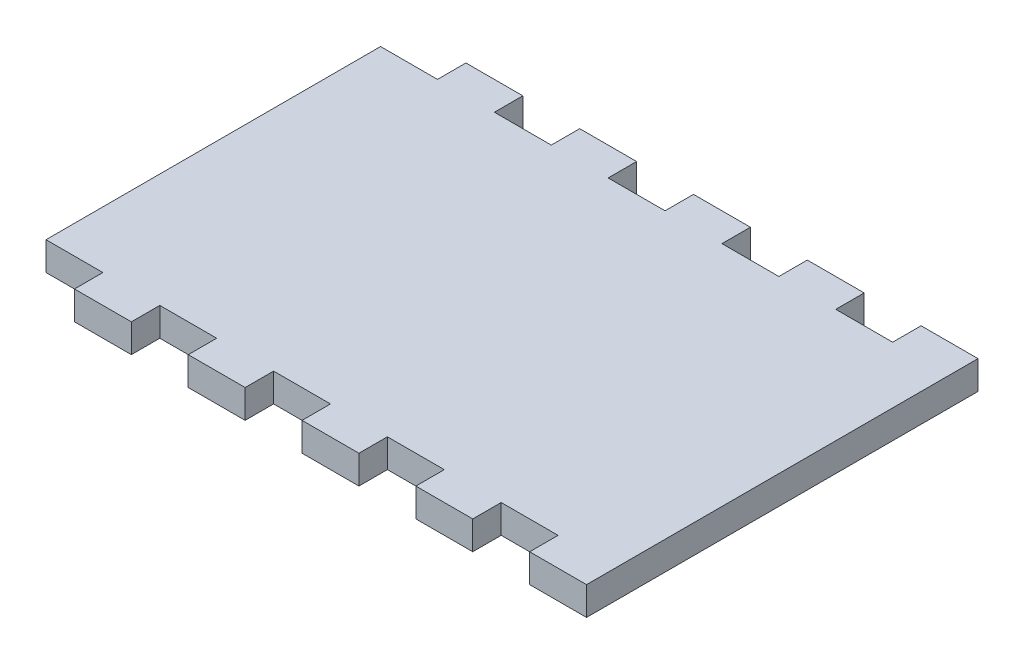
ISO-10303-21;
HEADER;
FILE_DESCRIPTION(('STEP AP214'),'2;1');
FILE_NAME('part.step','',(''),(''),'','','');
FILE_SCHEMA(('AUTOMOTIVE_DESIGN { 1 0 10303 214 1 1 1 1 }'));
ENDSEC;
DATA;
#1=APPLICATION_CONTEXT('core data for automotive mechanical design processes');
#2=APPLICATION_PROTOCOL_DEFINITION('international standard','automotive_design',2000,#1);
#3=PRODUCT_CONTEXT('',#1,'mechanical');
#4=PRODUCT('Part','Part','',(#3));
#5=PRODUCT_RELATED_PRODUCT_CATEGORY('part','',(#4));
#6=PRODUCT_DEFINITION_FORMATION('','',#4);
#7=PRODUCT_DEFINITION_CONTEXT('part definition',#1,'design');
#8=PRODUCT_DEFINITION('design','',#6,#7);
#9=PRODUCT_DEFINITION_SHAPE('','',#8);
#10=(LENGTH_UNIT() NAMED_UNIT(*) SI_UNIT(.MILLI.,.METRE.));
#11=(NAMED_UNIT(*) PLANE_ANGLE_UNIT() SI_UNIT($,.RADIAN.));
#12=(NAMED_UNIT(*) SI_UNIT($,.STERADIAN.) SOLID_ANGLE_UNIT());
#13=UNCERTAINTY_MEASURE_WITH_UNIT(LENGTH_MEASURE(1.E-05),#10,'distance_accuracy_value','');
#14=(GEOMETRIC_REPRESENTATION_CONTEXT(3) GLOBAL_UNCERTAINTY_ASSIGNED_CONTEXT((#13)) GLOBAL_UNIT_ASSIGNED_CONTEXT((#10,
#11,#12)) REPRESENTATION_CONTEXT('',''));
#15=CARTESIAN_POINT('',(0.,0.,0.));
#16=DIRECTION('',(0.,0.,1.));
#17=DIRECTION('',(1.,0.,0.));
#18=AXIS2_PLACEMENT_3D('',#15,#16,#17);
#19=CARTESIAN_POINT('',(0.,3.175,-43.688));
#20=DIRECTION('',(0.,0.,1.));
#21=DIRECTION('',(1.,0.,0.));
#22=AXIS2_PLACEMENT_3D('',#19,#20,#21);
#23=PLANE('',#22);
#24=DIRECTION('',(-1.,0.,0.));
#25=VECTOR('',#24,1.);
#26=CARTESIAN_POINT('',(0.,0.,-43.688));
#27=LINE('',#26,#25);
#28=CARTESIAN_POINT('',(38.1,0.,-43.688));
#29=VERTEX_POINT('',#28);
#30=CARTESIAN_POINT('',(31.75,0.,-43.688));
#31=VERTEX_POINT('',#30);
#32=EDGE_CURVE('E651',#29,#31,#27,.T.);
#33=ORIENTED_EDGE('',*,*,#32,.T.);
#34=DIRECTION('',(0.,1.,0.));
#35=VECTOR('',#34,1.);
#36=CARTESIAN_POINT('',(31.75,-7.09951582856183,-43.688));
#37=LINE('',#36,#35);
#38=CARTESIAN_POINT('',(31.75,3.175,-43.688));
#39=VERTEX_POINT('',#38);
#40=EDGE_CURVE('E351',#31,#39,#37,.T.);
#41=ORIENTED_EDGE('',*,*,#40,.T.);
#42=DIRECTION('',(-1.,0.,0.));
#43=VECTOR('',#42,1.);
#44=CARTESIAN_POINT('',(0.,3.175,-43.688));
#45=LINE('',#44,#43);
#46=CARTESIAN_POINT('',(38.1,3.175,-43.688));
#47=VERTEX_POINT('',#46);
#48=EDGE_CURVE('E671',#47,#39,#45,.T.);
#49=ORIENTED_EDGE('',*,*,#48,.F.);
#50=DIRECTION('',(0.,1.,0.));
#51=VECTOR('',#50,1.);
#52=CARTESIAN_POINT('',(38.1,-7.09951582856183,-43.688));
#53=LINE('',#52,#51);
#54=EDGE_CURVE('E396',#29,#47,#53,.T.);
#55=ORIENTED_EDGE('',*,*,#54,.F.);
#56=EDGE_LOOP('',(#33,#41,#49,#55));
#57=FACE_BOUND('',#56,.T.);
#58=ADVANCED_FACE('F35',(#57),#23,.F.);
#59=CARTESIAN_POINT('',(50.8,0.,-43.688));
#60=VERTEX_POINT('',#59);
#61=CARTESIAN_POINT('',(44.45,0.,-43.688));
#62=VERTEX_POINT('',#61);
#63=EDGE_CURVE('E574',#60,#62,#27,.T.);
#64=ORIENTED_EDGE('',*,*,#63,.T.);
#65=DIRECTION('',(0.,1.,0.));
#66=VECTOR('',#65,1.);
#67=CARTESIAN_POINT('',(44.45,-7.09951582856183,-43.688));
#68=LINE('',#67,#66);
#69=CARTESIAN_POINT('',(44.45,3.175,-43.688));
#70=VERTEX_POINT('',#69);
#71=EDGE_CURVE('E400',#62,#70,#68,.T.);
#72=ORIENTED_EDGE('',*,*,#71,.T.);
#73=CARTESIAN_POINT('',(50.8,3.175,-43.688));
#74=VERTEX_POINT('',#73);
#75=EDGE_CURVE('E562',#74,#70,#45,.T.);
#76=ORIENTED_EDGE('',*,*,#75,.F.);
#77=DIRECTION('',(0.,1.,0.));
#78=VECTOR('',#77,1.);
#79=CARTESIAN_POINT('',(50.8,-7.09951582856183,-43.688));
#80=LINE('',#79,#78);
#81=EDGE_CURVE('E448',#60,#74,#80,.T.);
#82=ORIENTED_EDGE('',*,*,#81,.F.);
#83=EDGE_LOOP('',(#64,#72,#76,#82));
#84=FACE_BOUND('',#83,.T.);
#85=ADVANCED_FACE('F701',(#84),#23,.F.);
#86=CARTESIAN_POINT('',(63.5,0.,-43.688));
#87=VERTEX_POINT('',#86);
#88=CARTESIAN_POINT('',(57.15,0.,-43.688));
#89=VERTEX_POINT('',#88);
#90=EDGE_CURVE('E551',#87,#89,#27,.T.);
#91=ORIENTED_EDGE('',*,*,#90,.T.);
#92=DIRECTION('',(0.,1.,0.));
#93=VECTOR('',#92,1.);
#94=CARTESIAN_POINT('',(57.15,-7.09951582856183,-43.688));
#95=LINE('',#94,#93);
#96=CARTESIAN_POINT('',(57.15,3.175,-43.688));
#97=VERTEX_POINT('',#96);
#98=EDGE_CURVE('E452',#89,#97,#95,.T.);
#99=ORIENTED_EDGE('',*,*,#98,.T.);
#100=CARTESIAN_POINT('',(63.5,3.175,-43.688));
#101=VERTEX_POINT('',#100);
#102=EDGE_CURVE('E559',#101,#97,#45,.T.);
#103=ORIENTED_EDGE('',*,*,#102,.F.);
#104=DIRECTION('',(0.,-1.,0.));
#105=VECTOR('',#104,1.);
#106=CARTESIAN_POINT('',(63.5,3.175,-43.688));
#107=LINE('',#106,#105);
#108=EDGE_CURVE('E43',#101,#87,#107,.T.);
#109=ORIENTED_EDGE('',*,*,#108,.T.);
#110=EDGE_LOOP('',(#91,#99,#103,#109));
#111=FACE_BOUND('',#110,.T.);
#112=ADVANCED_FACE('F581',(#111),#23,.F.);
#113=CARTESIAN_POINT('',(0.,3.175,0.));
#114=DIRECTION('',(0.,0.,-1.));
#115=DIRECTION('',(-1.,0.,0.));
#116=AXIS2_PLACEMENT_3D('',#113,#114,#115);
#117=PLANE('',#116);
#118=DIRECTION('',(1.,0.,0.));
#119=VECTOR('',#118,1.);
#120=CARTESIAN_POINT('',(0.,3.175,0.));
#121=LINE('',#120,#119);
#122=CARTESIAN_POINT('',(19.05,3.175,0.));
#123=VERTEX_POINT('',#122);
#124=CARTESIAN_POINT('',(25.4,3.175,0.));
#125=VERTEX_POINT('',#124);
#126=EDGE_CURVE('E556',#123,#125,#121,.T.);
#127=ORIENTED_EDGE('',*,*,#126,.F.);
#128=DIRECTION('',(0.,1.,0.));
#129=VECTOR('',#128,1.);
#130=CARTESIAN_POINT('',(19.05,-7.09951582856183,0.));
#131=LINE('',#130,#129);
#132=CARTESIAN_POINT('',(19.05,0.,0.));
#133=VERTEX_POINT('',#132);
#134=EDGE_CURVE('E328',#133,#123,#131,.T.);
#135=ORIENTED_EDGE('',*,*,#134,.F.);
#136=DIRECTION('',(1.,0.,0.));
#137=VECTOR('',#136,1.);
#138=CARTESIAN_POINT('',(0.,0.,0.));
#139=LINE('',#138,#137);
#140=CARTESIAN_POINT('',(25.4,0.,0.));
#141=VERTEX_POINT('',#140);
#142=EDGE_CURVE('E315',#133,#141,#139,.T.);
#143=ORIENTED_EDGE('',*,*,#142,.T.);
#144=DIRECTION('',(0.,1.,0.));
#145=VECTOR('',#144,1.);
#146=CARTESIAN_POINT('',(25.4,-7.09951582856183,0.));
#147=LINE('',#146,#145);
#148=EDGE_CURVE('E371',#141,#125,#147,.T.);
#149=ORIENTED_EDGE('',*,*,#148,.T.);
#150=EDGE_LOOP('',(#127,#135,#143,#149));
#151=FACE_BOUND('',#150,.T.);
#152=ADVANCED_FACE('F616',(#151),#117,.F.);
#153=CARTESIAN_POINT('',(31.75,3.175,0.));
#154=VERTEX_POINT('',#153);
#155=CARTESIAN_POINT('',(38.1,3.175,0.));
#156=VERTEX_POINT('',#155);
#157=EDGE_CURVE('E828',#154,#156,#121,.T.);
#158=ORIENTED_EDGE('',*,*,#157,.F.);
#159=DIRECTION('',(0.,1.,0.));
#160=VECTOR('',#159,1.);
#161=CARTESIAN_POINT('',(31.75,-7.09951582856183,0.));
#162=LINE('',#161,#160);
#163=CARTESIAN_POINT('',(31.75,0.,0.));
#164=VERTEX_POINT('',#163);
#165=EDGE_CURVE('E340',#164,#154,#162,.T.);
#166=ORIENTED_EDGE('',*,*,#165,.F.);
#167=CARTESIAN_POINT('',(38.1,0.,0.));
#168=VERTEX_POINT('',#167);
#169=EDGE_CURVE('E606',#164,#168,#139,.T.);
#170=ORIENTED_EDGE('',*,*,#169,.T.);
#171=DIRECTION('',(0.,1.,0.));
#172=VECTOR('',#171,1.);
#173=CARTESIAN_POINT('',(38.1,-7.09951582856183,0.));
#174=LINE('',#173,#172);
#175=EDGE_CURVE('E422',#168,#156,#174,.T.);
#176=ORIENTED_EDGE('',*,*,#175,.T.);
#177=EDGE_LOOP('',(#158,#166,#170,#176));
#178=FACE_BOUND('',#177,.T.);
#179=ADVANCED_FACE('F724',(#178),#117,.F.);
#180=CARTESIAN_POINT('',(44.45,3.175,0.));
#181=VERTEX_POINT('',#180);
#182=CARTESIAN_POINT('',(50.8,3.175,0.));
#183=VERTEX_POINT('',#182);
#184=EDGE_CURVE('E825',#181,#183,#121,.T.);
#185=ORIENTED_EDGE('',*,*,#184,.F.);
#186=DIRECTION('',(0.,1.,0.));
#187=VECTOR('',#186,1.);
#188=CARTESIAN_POINT('',(44.45,-7.09951582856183,0.));
#189=LINE('',#188,#187);
#190=CARTESIAN_POINT('',(44.45,0.,0.));
#191=VERTEX_POINT('',#190);
#192=EDGE_CURVE('E389',#191,#181,#189,.T.);
#193=ORIENTED_EDGE('',*,*,#192,.F.);
#194=CARTESIAN_POINT('',(50.8,0.,0.));
#195=VERTEX_POINT('',#194);
#196=EDGE_CURVE('E604',#191,#195,#139,.T.);
#197=ORIENTED_EDGE('',*,*,#196,.T.);
#198=DIRECTION('',(0.,1.,0.));
#199=VECTOR('',#198,1.);
#200=CARTESIAN_POINT('',(50.8,-7.09951582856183,0.));
#201=LINE('',#200,#199);
#202=EDGE_CURVE('E473',#195,#183,#201,.T.);
#203=ORIENTED_EDGE('',*,*,#202,.T.);
#204=EDGE_LOOP('',(#185,#193,#197,#203));
#205=FACE_BOUND('',#204,.T.);
#206=ADVANCED_FACE('F719',(#205),#117,.F.);
#207=CARTESIAN_POINT('',(57.15,3.175,0.));
#208=VERTEX_POINT('',#207);
#209=CARTESIAN_POINT('',(63.5,3.175,0.));
#210=VERTEX_POINT('',#209);
#211=EDGE_CURVE('E550',#208,#210,#121,.T.);
#212=ORIENTED_EDGE('',*,*,#211,.F.);
#213=DIRECTION('',(0.,1.,0.));
#214=VECTOR('',#213,1.);
#215=CARTESIAN_POINT('',(57.15,-7.09951582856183,0.));
#216=LINE('',#215,#214);
#217=CARTESIAN_POINT('',(57.15,0.,0.));
#218=VERTEX_POINT('',#217);
#219=EDGE_CURVE('E441',#218,#208,#216,.T.);
#220=ORIENTED_EDGE('',*,*,#219,.F.);
#221=CARTESIAN_POINT('',(63.5,0.,0.));
#222=VERTEX_POINT('',#221);
#223=EDGE_CURVE('E566',#218,#222,#139,.T.);
#224=ORIENTED_EDGE('',*,*,#223,.T.);
#225=DIRECTION('',(0.,-1.,0.));
#226=VECTOR('',#225,1.);
#227=CARTESIAN_POINT('',(63.5,3.175,0.));
#228=LINE('',#227,#226);
#229=EDGE_CURVE('E11',#210,#222,#228,.T.);
#230=ORIENTED_EDGE('',*,*,#229,.F.);
#231=EDGE_LOOP('',(#212,#220,#224,#230));
#232=FACE_BOUND('',#231,.T.);
#233=ADVANCED_FACE('F602',(#232),#117,.F.);
#234=CARTESIAN_POINT('',(25.4,3.175,-43.688));
#235=VERTEX_POINT('',#234);
#236=CARTESIAN_POINT('',(19.05,3.175,-43.688));
#237=VERTEX_POINT('',#236);
#238=EDGE_CURVE('E563',#235,#237,#45,.T.);
#239=ORIENTED_EDGE('',*,*,#238,.F.);
#240=DIRECTION('',(0.,1.,0.));
#241=VECTOR('',#240,1.);
#242=CARTESIAN_POINT('',(25.4,-7.09951582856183,-43.688));
#243=LINE('',#242,#241);
#244=CARTESIAN_POINT('',(25.4,0.,-43.688));
#245=VERTEX_POINT('',#244);
#246=EDGE_CURVE('E347',#245,#235,#243,.T.);
#247=ORIENTED_EDGE('',*,*,#246,.F.);
#248=CARTESIAN_POINT('',(19.05,0.,-43.688));
#249=VERTEX_POINT('',#248);
#250=EDGE_CURVE('E575',#245,#249,#27,.T.);
#251=ORIENTED_EDGE('',*,*,#250,.T.);
#252=DIRECTION('',(0.,1.,0.));
#253=VECTOR('',#252,1.);
#254=CARTESIAN_POINT('',(19.05,-7.09951582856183,-43.688));
#255=LINE('',#254,#253);
#256=EDGE_CURVE('E503',#249,#237,#255,.T.);
#257=ORIENTED_EDGE('',*,*,#256,.T.);
#258=EDGE_LOOP('',(#239,#247,#251,#257));
#259=FACE_BOUND('',#258,.T.);
#260=ADVANCED_FACE('F689',(#259),#23,.F.);
#261=CARTESIAN_POINT('',(0.,3.175,0.));
#262=DIRECTION('',(1.,0.,0.));
#263=DIRECTION('',(0.,0.,-1.));
#264=AXIS2_PLACEMENT_3D('',#261,#262,#263);
#265=PLANE('',#264);
#266=DIRECTION('',(0.,0.,1.));
#267=VECTOR('',#266,1.);
#268=CARTESIAN_POINT('',(0.,0.,0.));
#269=LINE('',#268,#267);
#270=CARTESIAN_POINT('',(0.,0.,-40.513));
#271=VERTEX_POINT('',#270);
#272=CARTESIAN_POINT('',(0.,0.,-3.175));
#273=VERTEX_POINT('',#272);
#274=EDGE_CURVE('E546',#271,#273,#269,.T.);
#275=ORIENTED_EDGE('',*,*,#274,.T.);
#276=DIRECTION('',(0.,1.,0.));
#277=VECTOR('',#276,1.);
#278=CARTESIAN_POINT('',(0.,-7.09951582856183,-3.175));
#279=LINE('',#278,#277);
#280=CARTESIAN_POINT('',(0.,3.175,-3.175));
#281=VERTEX_POINT('',#280);
#282=EDGE_CURVE('E521',#273,#281,#279,.T.);
#283=ORIENTED_EDGE('',*,*,#282,.T.);
#284=DIRECTION('',(0.,0.,1.));
#285=VECTOR('',#284,1.);
#286=CARTESIAN_POINT('',(0.,3.175,0.));
#287=LINE('',#286,#285);
#288=CARTESIAN_POINT('',(0.,3.175,-40.513));
#289=VERTEX_POINT('',#288);
#290=EDGE_CURVE('E547',#289,#281,#287,.T.);
#291=ORIENTED_EDGE('',*,*,#290,.F.);
#292=DIRECTION('',(0.,1.,0.));
#293=VECTOR('',#292,1.);
#294=CARTESIAN_POINT('',(0.,-7.09951582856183,-40.513));
#295=LINE('',#294,#293);
#296=EDGE_CURVE('E543',#271,#289,#295,.T.);
#297=ORIENTED_EDGE('',*,*,#296,.F.);
#298=EDGE_LOOP('',(#275,#283,#291,#297));
#299=FACE_BOUND('',#298,.T.);
#300=ADVANCED_FACE('F37',(#299),#265,.F.);
#301=CARTESIAN_POINT('',(6.35,0.,0.));
#302=VERTEX_POINT('',#301);
#303=CARTESIAN_POINT('',(12.7,0.,0.));
#304=VERTEX_POINT('',#303);
#305=EDGE_CURVE('E567',#302,#304,#139,.T.);
#306=ORIENTED_EDGE('',*,*,#305,.T.);
#307=DIRECTION('',(0.,1.,0.));
#308=VECTOR('',#307,1.);
#309=CARTESIAN_POINT('',(12.7,-7.09951582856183,0.));
#310=LINE('',#309,#308);
#311=CARTESIAN_POINT('',(12.7,3.175,0.));
#312=VERTEX_POINT('',#311);
#313=EDGE_CURVE('E324',#304,#312,#310,.T.);
#314=ORIENTED_EDGE('',*,*,#313,.T.);
#315=CARTESIAN_POINT('',(6.35,3.175,0.));
#316=VERTEX_POINT('',#315);
#317=EDGE_CURVE('E552',#316,#312,#121,.T.);
#318=ORIENTED_EDGE('',*,*,#317,.F.);
#319=DIRECTION('',(0.,1.,0.));
#320=VECTOR('',#319,1.);
#321=CARTESIAN_POINT('',(6.35,-7.09951582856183,0.));
#322=LINE('',#321,#320);
#323=EDGE_CURVE('E524',#302,#316,#322,.T.);
#324=ORIENTED_EDGE('',*,*,#323,.F.);
#325=EDGE_LOOP('',(#306,#314,#318,#324));
#326=FACE_BOUND('',#325,.T.);
#327=ADVANCED_FACE('F625',(#326),#117,.F.);
#328=CARTESIAN_POINT('',(63.5,3.175,0.));
#329=DIRECTION('',(-1.,0.,0.));
#330=DIRECTION('',(0.,0.,1.));
#331=AXIS2_PLACEMENT_3D('',#328,#329,#330);
#332=PLANE('',#331);
#333=DIRECTION('',(0.,0.,-1.));
#334=VECTOR('',#333,1.);
#335=CARTESIAN_POINT('',(63.5,0.,0.));
#336=LINE('',#335,#334);
#337=EDGE_CURVE('E570',#222,#87,#336,.T.);
#338=ORIENTED_EDGE('',*,*,#337,.T.);
#339=ORIENTED_EDGE('',*,*,#108,.F.);
#340=DIRECTION('',(0.,0.,-1.));
#341=VECTOR('',#340,1.);
#342=CARTESIAN_POINT('',(63.5,3.175,0.));
#343=LINE('',#342,#341);
#344=EDGE_CURVE('E555',#210,#101,#343,.T.);
#345=ORIENTED_EDGE('',*,*,#344,.F.);
#346=ORIENTED_EDGE('',*,*,#229,.T.);
#347=EDGE_LOOP('',(#338,#339,#345,#346));
#348=FACE_BOUND('',#347,.T.);
#349=ADVANCED_FACE('F600',(#348),#332,.F.);
#350=CARTESIAN_POINT('',(12.7,3.175,-43.688));
#351=VERTEX_POINT('',#350);
#352=CARTESIAN_POINT('',(6.35,3.175,-43.688));
#353=VERTEX_POINT('',#352);
#354=EDGE_CURVE('E558',#351,#353,#45,.T.);
#355=ORIENTED_EDGE('',*,*,#354,.F.);
#356=DIRECTION('',(0.,1.,0.));
#357=VECTOR('',#356,1.);
#358=CARTESIAN_POINT('',(12.7,-7.09951582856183,-43.688));
#359=LINE('',#358,#357);
#360=CARTESIAN_POINT('',(12.7,0.,-43.688));
#361=VERTEX_POINT('',#360);
#362=EDGE_CURVE('E499',#361,#351,#359,.T.);
#363=ORIENTED_EDGE('',*,*,#362,.F.);
#364=CARTESIAN_POINT('',(6.35,0.,-43.688));
#365=VERTEX_POINT('',#364);
#366=EDGE_CURVE('E572',#361,#365,#27,.T.);
#367=ORIENTED_EDGE('',*,*,#366,.T.);
#368=DIRECTION('',(0.,1.,0.));
#369=VECTOR('',#368,1.);
#370=CARTESIAN_POINT('',(6.35,-7.09951582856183,-43.688));
#371=LINE('',#370,#369);
#372=EDGE_CURVE('E540',#365,#353,#371,.T.);
#373=ORIENTED_EDGE('',*,*,#372,.T.);
#374=EDGE_LOOP('',(#355,#363,#367,#373));
#375=FACE_BOUND('',#374,.T.);
#376=ADVANCED_FACE('F649',(#375),#23,.F.);
#377=CARTESIAN_POINT('',(0.,3.175,0.));
#378=DIRECTION('',(0.,-1.,0.));
#379=DIRECTION('',(0.,0.,-1.));
#380=AXIS2_PLACEMENT_3D('',#377,#378,#379);
#381=PLANE('',#380);
#382=DIRECTION('',(-1.,0.,0.));
#383=VECTOR('',#382,1.);
#384=CARTESIAN_POINT('',(12.7,3.175,-3.175));
#385=LINE('',#384,#383);
#386=CARTESIAN_POINT('',(19.05,3.175,-3.175));
#387=VERTEX_POINT('',#386);
#388=CARTESIAN_POINT('',(12.7,3.175,-3.175));
#389=VERTEX_POINT('',#388);
#390=EDGE_CURVE('E318',#387,#389,#385,.T.);
#391=ORIENTED_EDGE('',*,*,#390,.F.);
#392=DIRECTION('',(0.,0.,-1.));
#393=VECTOR('',#392,1.);
#394=CARTESIAN_POINT('',(19.05,3.175,0.));
#395=LINE('',#394,#393);
#396=EDGE_CURVE('E308',#123,#387,#395,.T.);
#397=ORIENTED_EDGE('',*,*,#396,.F.);
#398=ORIENTED_EDGE('',*,*,#126,.T.);
#399=DIRECTION('',(0.,0.,1.));
#400=VECTOR('',#399,1.);
#401=CARTESIAN_POINT('',(25.4,3.175,0.));
#402=LINE('',#401,#400);
#403=CARTESIAN_POINT('',(25.4,3.175,-3.175));
#404=VERTEX_POINT('',#403);
#405=EDGE_CURVE('E357',#404,#125,#402,.T.);
#406=ORIENTED_EDGE('',*,*,#405,.F.);
#407=DIRECTION('',(-1.,0.,0.));
#408=VECTOR('',#407,1.);
#409=CARTESIAN_POINT('',(25.4,3.175,-3.175));
#410=LINE('',#409,#408);
#411=CARTESIAN_POINT('',(31.75,3.175,-3.175));
#412=VERTEX_POINT('',#411);
#413=EDGE_CURVE('E360',#412,#404,#410,.T.);
#414=ORIENTED_EDGE('',*,*,#413,.F.);
#415=DIRECTION('',(0.,0.,-1.));
#416=VECTOR('',#415,1.);
#417=CARTESIAN_POINT('',(31.75,3.175,0.));
#418=LINE('',#417,#416);
#419=EDGE_CURVE('E363',#154,#412,#418,.T.);
#420=ORIENTED_EDGE('',*,*,#419,.F.);
#421=ORIENTED_EDGE('',*,*,#157,.T.);
#422=DIRECTION('',(0.,0.,1.));
#423=VECTOR('',#422,1.);
#424=CARTESIAN_POINT('',(38.1,3.175,0.));
#425=LINE('',#424,#423);
#426=CARTESIAN_POINT('',(38.1,3.175,-3.175));
#427=VERTEX_POINT('',#426);
#428=EDGE_CURVE('E406',#427,#156,#425,.T.);
#429=ORIENTED_EDGE('',*,*,#428,.F.);
#430=DIRECTION('',(-1.,0.,0.));
#431=VECTOR('',#430,1.);
#432=CARTESIAN_POINT('',(38.1,3.175,-3.175));
#433=LINE('',#432,#431);
#434=CARTESIAN_POINT('',(44.45,3.175,-3.175));
#435=VERTEX_POINT('',#434);
#436=EDGE_CURVE('E409',#435,#427,#433,.T.);
#437=ORIENTED_EDGE('',*,*,#436,.F.);
#438=DIRECTION('',(0.,0.,-1.));
#439=VECTOR('',#438,1.);
#440=CARTESIAN_POINT('',(44.45,3.175,0.));
#441=LINE('',#440,#439);
#442=EDGE_CURVE('E412',#181,#435,#441,.T.);
#443=ORIENTED_EDGE('',*,*,#442,.F.);
#444=ORIENTED_EDGE('',*,*,#184,.T.);
#445=DIRECTION('',(0.,0.,1.));
#446=VECTOR('',#445,1.);
#447=CARTESIAN_POINT('',(50.8,3.175,0.));
#448=LINE('',#447,#446);
#449=CARTESIAN_POINT('',(50.8,3.175,-3.175));
#450=VERTEX_POINT('',#449);
#451=EDGE_CURVE('E458',#450,#183,#448,.T.);
#452=ORIENTED_EDGE('',*,*,#451,.F.);
#453=DIRECTION('',(-1.,0.,0.));
#454=VECTOR('',#453,1.);
#455=CARTESIAN_POINT('',(50.8,3.175,-3.175));
#456=LINE('',#455,#454);
#457=CARTESIAN_POINT('',(57.15,3.175,-3.175));
#458=VERTEX_POINT('',#457);
#459=EDGE_CURVE('E461',#458,#450,#456,.T.);
#460=ORIENTED_EDGE('',*,*,#459,.F.);
#461=DIRECTION('',(0.,0.,-1.));
#462=VECTOR('',#461,1.);
#463=CARTESIAN_POINT('',(57.15,3.175,0.));
#464=LINE('',#463,#462);
#465=EDGE_CURVE('E464',#208,#458,#464,.T.);
#466=ORIENTED_EDGE('',*,*,#465,.F.);
#467=ORIENTED_EDGE('',*,*,#211,.T.);
#468=ORIENTED_EDGE('',*,*,#344,.T.);
#469=ORIENTED_EDGE('',*,*,#102,.T.);
#470=DIRECTION('',(0.,0.,-1.));
#471=VECTOR('',#470,1.);
#472=CARTESIAN_POINT('',(57.15,3.175,-43.688));
#473=LINE('',#472,#471);
#474=CARTESIAN_POINT('',(57.15,3.175,-40.513));
#475=VERTEX_POINT('',#474);
#476=EDGE_CURVE('E432',#475,#97,#473,.T.);
#477=ORIENTED_EDGE('',*,*,#476,.F.);
#478=DIRECTION('',(1.,0.,0.));
#479=VECTOR('',#478,1.);
#480=CARTESIAN_POINT('',(50.8,3.175,-40.513));
#481=LINE('',#480,#479);
#482=CARTESIAN_POINT('',(50.8,3.175,-40.513));
#483=VERTEX_POINT('',#482);
#484=EDGE_CURVE('E435',#483,#475,#481,.T.);
#485=ORIENTED_EDGE('',*,*,#484,.F.);
#486=DIRECTION('',(0.,0.,1.));
#487=VECTOR('',#486,1.);
#488=CARTESIAN_POINT('',(50.8,3.175,-43.688));
#489=LINE('',#488,#487);
#490=EDGE_CURVE('E438',#74,#483,#489,.T.);
#491=ORIENTED_EDGE('',*,*,#490,.F.);
#492=ORIENTED_EDGE('',*,*,#75,.T.);
#493=DIRECTION('',(0.,0.,-1.));
#494=VECTOR('',#493,1.);
#495=CARTESIAN_POINT('',(44.45,3.175,-43.688));
#496=LINE('',#495,#494);
#497=CARTESIAN_POINT('',(44.45,3.175,-40.513));
#498=VERTEX_POINT('',#497);
#499=EDGE_CURVE('E381',#498,#70,#496,.T.);
#500=ORIENTED_EDGE('',*,*,#499,.F.);
#501=DIRECTION('',(1.,0.,0.));
#502=VECTOR('',#501,1.);
#503=CARTESIAN_POINT('',(38.1,3.175,-40.513));
#504=LINE('',#503,#502);
#505=CARTESIAN_POINT('',(38.1,3.175,-40.513));
#506=VERTEX_POINT('',#505);
#507=EDGE_CURVE('E384',#506,#498,#504,.T.);
#508=ORIENTED_EDGE('',*,*,#507,.F.);
#509=DIRECTION('',(0.,0.,1.));
#510=VECTOR('',#509,1.);
#511=CARTESIAN_POINT('',(38.1,3.175,-43.688));
#512=LINE('',#511,#510);
#513=EDGE_CURVE('E387',#47,#506,#512,.T.);
#514=ORIENTED_EDGE('',*,*,#513,.F.);
#515=ORIENTED_EDGE('',*,*,#48,.T.);
#516=DIRECTION('',(0.,0.,-1.));
#517=VECTOR('',#516,1.);
#518=CARTESIAN_POINT('',(31.75,3.175,-43.688));
#519=LINE('',#518,#517);
#520=CARTESIAN_POINT('',(31.75,3.175,-40.513));
#521=VERTEX_POINT('',#520);
#522=EDGE_CURVE('E332',#521,#39,#519,.T.);
#523=ORIENTED_EDGE('',*,*,#522,.F.);
#524=DIRECTION('',(1.,0.,0.));
#525=VECTOR('',#524,1.);
#526=CARTESIAN_POINT('',(25.4,3.175,-40.513));
#527=LINE('',#526,#525);
#528=CARTESIAN_POINT('',(25.4,3.175,-40.513));
#529=VERTEX_POINT('',#528);
#530=EDGE_CURVE('E335',#529,#521,#527,.T.);
#531=ORIENTED_EDGE('',*,*,#530,.F.);
#532=DIRECTION('',(0.,0.,1.));
#533=VECTOR('',#532,1.);
#534=CARTESIAN_POINT('',(25.4,3.175,-43.688));
#535=LINE('',#534,#533);
#536=EDGE_CURVE('E338',#235,#529,#535,.T.);
#537=ORIENTED_EDGE('',*,*,#536,.F.);
#538=ORIENTED_EDGE('',*,*,#238,.T.);
#539=DIRECTION('',(0.,0.,-1.));
#540=VECTOR('',#539,1.);
#541=CARTESIAN_POINT('',(19.05,3.175,-43.688));
#542=LINE('',#541,#540);
#543=CARTESIAN_POINT('',(19.05,3.175,-40.513));
#544=VERTEX_POINT('',#543);
#545=EDGE_CURVE('E483',#544,#237,#542,.T.);
#546=ORIENTED_EDGE('',*,*,#545,.F.);
#547=DIRECTION('',(1.,0.,0.));
#548=VECTOR('',#547,1.);
#549=CARTESIAN_POINT('',(12.7,3.175,-40.513));
#550=LINE('',#549,#548);
#551=CARTESIAN_POINT('',(12.7,3.175,-40.513));
#552=VERTEX_POINT('',#551);
#553=EDGE_CURVE('E487',#552,#544,#550,.T.);
#554=ORIENTED_EDGE('',*,*,#553,.F.);
#555=DIRECTION('',(0.,0.,1.));
#556=VECTOR('',#555,1.);
#557=CARTESIAN_POINT('',(12.7,3.175,-43.688));
#558=LINE('',#557,#556);
#559=EDGE_CURVE('E331',#351,#552,#558,.T.);
#560=ORIENTED_EDGE('',*,*,#559,.F.);
#561=ORIENTED_EDGE('',*,*,#354,.T.);
#562=DIRECTION('',(0.,0.,-1.));
#563=VECTOR('',#562,1.);
#564=CARTESIAN_POINT('',(6.35,3.175,-43.688));
#565=LINE('',#564,#563);
#566=CARTESIAN_POINT('',(6.35,3.175,-40.513));
#567=VERTEX_POINT('',#566);
#568=EDGE_CURVE('E528',#567,#353,#565,.T.);
#569=ORIENTED_EDGE('',*,*,#568,.F.);
#570=DIRECTION('',(1.,0.,0.));
#571=VECTOR('',#570,1.);
#572=CARTESIAN_POINT('',(0.,3.175,-40.513));
#573=LINE('',#572,#571);
#574=EDGE_CURVE('E527',#289,#567,#573,.T.);
#575=ORIENTED_EDGE('',*,*,#574,.F.);
#576=ORIENTED_EDGE('',*,*,#290,.T.);
#577=DIRECTION('',(-1.,0.,0.));
#578=VECTOR('',#577,1.);
#579=CARTESIAN_POINT('',(0.,3.175,-3.175));
#580=LINE('',#579,#578);
#581=CARTESIAN_POINT('',(6.35,3.175,-3.175));
#582=VERTEX_POINT('',#581);
#583=EDGE_CURVE('E510',#582,#281,#580,.T.);
#584=ORIENTED_EDGE('',*,*,#583,.F.);
#585=DIRECTION('',(0.,0.,-1.));
#586=VECTOR('',#585,1.);
#587=CARTESIAN_POINT('',(6.35,3.175,0.));
#588=LINE('',#587,#586);
#589=EDGE_CURVE('E509',#316,#582,#588,.T.);
#590=ORIENTED_EDGE('',*,*,#589,.F.);
#591=ORIENTED_EDGE('',*,*,#317,.T.);
#592=DIRECTION('',(0.,0.,1.));
#593=VECTOR('',#592,1.);
#594=CARTESIAN_POINT('',(12.7,3.175,0.));
#595=LINE('',#594,#593);
#596=EDGE_CURVE('E316',#389,#312,#595,.T.);
#597=ORIENTED_EDGE('',*,*,#596,.F.);
#598=EDGE_LOOP('',(#391,#397,#398,#406,#414,#420,#421,#429,#437,#443,#444,#452,#460,#466,#467,
#468,#469,#477,#485,#491,#492,#500,#508,#514,#515,#523,#531,#537,#538,#546,#554,#560,#561,#569,
#575,#576,#584,#590,#591,#597));
#599=FACE_BOUND('',#598,.T.);
#600=ADVANCED_FACE('F596',(#599),#381,.F.);
#601=CARTESIAN_POINT('',(0.,0.,0.));
#602=DIRECTION('',(0.,-1.,0.));
#603=DIRECTION('',(0.,0.,-1.));
#604=AXIS2_PLACEMENT_3D('',#601,#602,#603);
#605=PLANE('',#604);
#606=DIRECTION('',(0.,0.,-1.));
#607=VECTOR('',#606,1.);
#608=CARTESIAN_POINT('',(19.05,0.,0.));
#609=LINE('',#608,#607);
#610=CARTESIAN_POINT('',(19.05,0.,-3.175));
#611=VERTEX_POINT('',#610);
#612=EDGE_CURVE('E305',#133,#611,#609,.T.);
#613=ORIENTED_EDGE('',*,*,#612,.T.);
#614=DIRECTION('',(-1.,0.,0.));
#615=VECTOR('',#614,1.);
#616=CARTESIAN_POINT('',(12.7,0.,-3.175));
#617=LINE('',#616,#615);
#618=CARTESIAN_POINT('',(12.7,0.,-3.175));
#619=VERTEX_POINT('',#618);
#620=EDGE_CURVE('E292',#611,#619,#617,.T.);
#621=ORIENTED_EDGE('',*,*,#620,.T.);
#622=DIRECTION('',(0.,0.,1.));
#623=VECTOR('',#622,1.);
#624=CARTESIAN_POINT('',(12.7,0.,0.));
#625=LINE('',#624,#623);
#626=EDGE_CURVE('E323',#619,#304,#625,.T.);
#627=ORIENTED_EDGE('',*,*,#626,.T.);
#628=ORIENTED_EDGE('',*,*,#305,.F.);
#629=DIRECTION('',(0.,0.,-1.));
#630=VECTOR('',#629,1.);
#631=CARTESIAN_POINT('',(6.35,0.,0.));
#632=LINE('',#631,#630);
#633=CARTESIAN_POINT('',(6.35,0.,-3.175));
#634=VERTEX_POINT('',#633);
#635=EDGE_CURVE('E512',#302,#634,#632,.T.);
#636=ORIENTED_EDGE('',*,*,#635,.T.);
#637=DIRECTION('',(-1.,0.,0.));
#638=VECTOR('',#637,1.);
#639=CARTESIAN_POINT('',(0.,0.,-3.175));
#640=LINE('',#639,#638);
#641=EDGE_CURVE('E518',#634,#273,#640,.T.);
#642=ORIENTED_EDGE('',*,*,#641,.T.);
#643=ORIENTED_EDGE('',*,*,#274,.F.);
#644=DIRECTION('',(1.,0.,0.));
#645=VECTOR('',#644,1.);
#646=CARTESIAN_POINT('',(0.,0.,-40.513));
#647=LINE('',#646,#645);
#648=CARTESIAN_POINT('',(6.35,0.,-40.513));
#649=VERTEX_POINT('',#648);
#650=EDGE_CURVE('E531',#271,#649,#647,.T.);
#651=ORIENTED_EDGE('',*,*,#650,.T.);
#652=DIRECTION('',(0.,0.,-1.));
#653=VECTOR('',#652,1.);
#654=CARTESIAN_POINT('',(6.35,0.,-43.688));
#655=LINE('',#654,#653);
#656=EDGE_CURVE('E537',#649,#365,#655,.T.);
#657=ORIENTED_EDGE('',*,*,#656,.T.);
#658=ORIENTED_EDGE('',*,*,#366,.F.);
#659=DIRECTION('',(0.,0.,1.));
#660=VECTOR('',#659,1.);
#661=CARTESIAN_POINT('',(12.7,0.,-43.688));
#662=LINE('',#661,#660);
#663=CARTESIAN_POINT('',(12.7,0.,-40.513));
#664=VERTEX_POINT('',#663);
#665=EDGE_CURVE('E495',#361,#664,#662,.T.);
#666=ORIENTED_EDGE('',*,*,#665,.T.);
#667=DIRECTION('',(1.,0.,0.));
#668=VECTOR('',#667,1.);
#669=CARTESIAN_POINT('',(12.7,0.,-40.513));
#670=LINE('',#669,#668);
#671=CARTESIAN_POINT('',(19.05,0.,-40.513));
#672=VERTEX_POINT('',#671);
#673=EDGE_CURVE('E486',#664,#672,#670,.T.);
#674=ORIENTED_EDGE('',*,*,#673,.T.);
#675=DIRECTION('',(0.,0.,-1.));
#676=VECTOR('',#675,1.);
#677=CARTESIAN_POINT('',(19.05,0.,-43.688));
#678=LINE('',#677,#676);
#679=EDGE_CURVE('E500',#672,#249,#678,.T.);
#680=ORIENTED_EDGE('',*,*,#679,.T.);
#681=ORIENTED_EDGE('',*,*,#250,.F.);
#682=DIRECTION('',(0.,0.,1.));
#683=VECTOR('',#682,1.);
#684=CARTESIAN_POINT('',(25.4,0.,-43.688));
#685=LINE('',#684,#683);
#686=CARTESIAN_POINT('',(25.4,0.,-40.513));
#687=VERTEX_POINT('',#686);
#688=EDGE_CURVE('E344',#245,#687,#685,.T.);
#689=ORIENTED_EDGE('',*,*,#688,.T.);
#690=DIRECTION('',(1.,0.,0.));
#691=VECTOR('',#690,1.);
#692=CARTESIAN_POINT('',(25.4,0.,-40.513));
#693=LINE('',#692,#691);
#694=CARTESIAN_POINT('',(31.75,0.,-40.513));
#695=VERTEX_POINT('',#694);
#696=EDGE_CURVE('E334',#687,#695,#693,.T.);
#697=ORIENTED_EDGE('',*,*,#696,.T.);
#698=DIRECTION('',(0.,0.,-1.));
#699=VECTOR('',#698,1.);
#700=CARTESIAN_POINT('',(31.75,0.,-43.688));
#701=LINE('',#700,#699);
#702=EDGE_CURVE('E348',#695,#31,#701,.T.);
#703=ORIENTED_EDGE('',*,*,#702,.T.);
#704=ORIENTED_EDGE('',*,*,#32,.F.);
#705=DIRECTION('',(0.,0.,1.));
#706=VECTOR('',#705,1.);
#707=CARTESIAN_POINT('',(38.1,0.,-43.688));
#708=LINE('',#707,#706);
#709=CARTESIAN_POINT('',(38.1,0.,-40.513));
#710=VERTEX_POINT('',#709);
#711=EDGE_CURVE('E393',#29,#710,#708,.T.);
#712=ORIENTED_EDGE('',*,*,#711,.T.);
#713=DIRECTION('',(1.,0.,0.));
#714=VECTOR('',#713,1.);
#715=CARTESIAN_POINT('',(38.1,0.,-40.513));
#716=LINE('',#715,#714);
#717=CARTESIAN_POINT('',(44.45,0.,-40.513));
#718=VERTEX_POINT('',#717);
#719=EDGE_CURVE('E383',#710,#718,#716,.T.);
#720=ORIENTED_EDGE('',*,*,#719,.T.);
#721=DIRECTION('',(0.,0.,-1.));
#722=VECTOR('',#721,1.);
#723=CARTESIAN_POINT('',(44.45,0.,-43.688));
#724=LINE('',#723,#722);
#725=EDGE_CURVE('E397',#718,#62,#724,.T.);
#726=ORIENTED_EDGE('',*,*,#725,.T.);
#727=ORIENTED_EDGE('',*,*,#63,.F.);
#728=DIRECTION('',(0.,0.,1.));
#729=VECTOR('',#728,1.);
#730=CARTESIAN_POINT('',(50.8,0.,-43.688));
#731=LINE('',#730,#729);
#732=CARTESIAN_POINT('',(50.8,0.,-40.513));
#733=VERTEX_POINT('',#732);
#734=EDGE_CURVE('E445',#60,#733,#731,.T.);
#735=ORIENTED_EDGE('',*,*,#734,.T.);
#736=DIRECTION('',(1.,0.,0.));
#737=VECTOR('',#736,1.);
#738=CARTESIAN_POINT('',(50.8,0.,-40.513));
#739=LINE('',#738,#737);
#740=CARTESIAN_POINT('',(57.15,0.,-40.513));
#741=VERTEX_POINT('',#740);
#742=EDGE_CURVE('E434',#733,#741,#739,.T.);
#743=ORIENTED_EDGE('',*,*,#742,.T.);
#744=DIRECTION('',(0.,0.,-1.));
#745=VECTOR('',#744,1.);
#746=CARTESIAN_POINT('',(57.15,0.,-43.688));
#747=LINE('',#746,#745);
#748=EDGE_CURVE('E449',#741,#89,#747,.T.);
#749=ORIENTED_EDGE('',*,*,#748,.T.);
#750=ORIENTED_EDGE('',*,*,#90,.F.);
#751=ORIENTED_EDGE('',*,*,#337,.F.);
#752=ORIENTED_EDGE('',*,*,#223,.F.);
#753=DIRECTION('',(0.,0.,-1.));
#754=VECTOR('',#753,1.);
#755=CARTESIAN_POINT('',(57.15,0.,0.));
#756=LINE('',#755,#754);
#757=CARTESIAN_POINT('',(57.15,0.,-3.175));
#758=VERTEX_POINT('',#757);
#759=EDGE_CURVE('E460',#218,#758,#756,.T.);
#760=ORIENTED_EDGE('',*,*,#759,.T.);
#761=DIRECTION('',(-1.,0.,0.));
#762=VECTOR('',#761,1.);
#763=CARTESIAN_POINT('',(50.8,0.,-3.175));
#764=LINE('',#763,#762);
#765=CARTESIAN_POINT('',(50.8,0.,-3.175));
#766=VERTEX_POINT('',#765);
#767=EDGE_CURVE('E475',#758,#766,#764,.T.);
#768=ORIENTED_EDGE('',*,*,#767,.T.);
#769=DIRECTION('',(0.,0.,1.));
#770=VECTOR('',#769,1.);
#771=CARTESIAN_POINT('',(50.8,0.,0.));
#772=LINE('',#771,#770);
#773=EDGE_CURVE('E470',#766,#195,#772,.T.);
#774=ORIENTED_EDGE('',*,*,#773,.T.);
#775=ORIENTED_EDGE('',*,*,#196,.F.);
#776=DIRECTION('',(0.,0.,-1.));
#777=VECTOR('',#776,1.);
#778=CARTESIAN_POINT('',(44.45,0.,0.));
#779=LINE('',#778,#777);
#780=CARTESIAN_POINT('',(44.45,0.,-3.175));
#781=VERTEX_POINT('',#780);
#782=EDGE_CURVE('E408',#191,#781,#779,.T.);
#783=ORIENTED_EDGE('',*,*,#782,.T.);
#784=DIRECTION('',(-1.,0.,0.));
#785=VECTOR('',#784,1.);
#786=CARTESIAN_POINT('',(38.1,0.,-3.175));
#787=LINE('',#786,#785);
#788=CARTESIAN_POINT('',(38.1,0.,-3.175));
#789=VERTEX_POINT('',#788);
#790=EDGE_CURVE('E424',#781,#789,#787,.T.);
#791=ORIENTED_EDGE('',*,*,#790,.T.);
#792=DIRECTION('',(0.,0.,1.));
#793=VECTOR('',#792,1.);
#794=CARTESIAN_POINT('',(38.1,0.,0.));
#795=LINE('',#794,#793);
#796=EDGE_CURVE('E419',#789,#168,#795,.T.);
#797=ORIENTED_EDGE('',*,*,#796,.T.);
#798=ORIENTED_EDGE('',*,*,#169,.F.);
#799=DIRECTION('',(0.,0.,-1.));
#800=VECTOR('',#799,1.);
#801=CARTESIAN_POINT('',(31.75,0.,0.));
#802=LINE('',#801,#800);
#803=CARTESIAN_POINT('',(31.75,0.,-3.175));
#804=VERTEX_POINT('',#803);
#805=EDGE_CURVE('E359',#164,#804,#802,.T.);
#806=ORIENTED_EDGE('',*,*,#805,.T.);
#807=DIRECTION('',(-1.,0.,0.));
#808=VECTOR('',#807,1.);
#809=CARTESIAN_POINT('',(25.4,0.,-3.175));
#810=LINE('',#809,#808);
#811=CARTESIAN_POINT('',(25.4,0.,-3.175));
#812=VERTEX_POINT('',#811);
#813=EDGE_CURVE('E373',#804,#812,#810,.T.);
#814=ORIENTED_EDGE('',*,*,#813,.T.);
#815=DIRECTION('',(0.,0.,1.));
#816=VECTOR('',#815,1.);
#817=CARTESIAN_POINT('',(25.4,0.,0.));
#818=LINE('',#817,#816);
#819=EDGE_CURVE('E369',#812,#141,#818,.T.);
#820=ORIENTED_EDGE('',*,*,#819,.T.);
#821=ORIENTED_EDGE('',*,*,#142,.F.);
#822=EDGE_LOOP('',(#613,#621,#627,#628,#636,#642,#643,#651,#657,#658,#666,#674,#680,#681,#689,
#697,#703,#704,#712,#720,#726,#727,#735,#743,#749,#750,#751,#752,#760,#768,#774,#775,#783,#791,
#797,#798,#806,#814,#820,#821));
#823=FACE_BOUND('',#822,.T.);
#824=ADVANCED_FACE('F312',(#823),#605,.T.);
#825=CARTESIAN_POINT('',(0.,-7.09951582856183,-40.513));
#826=DIRECTION('',(0.,0.,1.));
#827=DIRECTION('',(1.,0.,0.));
#828=AXIS2_PLACEMENT_3D('',#825,#826,#827);
#829=PLANE('',#828);
#830=ORIENTED_EDGE('',*,*,#296,.T.);
#831=ORIENTED_EDGE('',*,*,#574,.T.);
#832=DIRECTION('',(0.,1.,0.));
#833=VECTOR('',#832,1.);
#834=CARTESIAN_POINT('',(6.35,-7.09951582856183,-40.513));
#835=LINE('',#834,#833);
#836=EDGE_CURVE('E536',#649,#567,#835,.T.);
#837=ORIENTED_EDGE('',*,*,#836,.F.);
#838=ORIENTED_EDGE('',*,*,#650,.F.);
#839=EDGE_LOOP('',(#830,#831,#837,#838));
#840=FACE_BOUND('',#839,.T.);
#841=ADVANCED_FACE('F642',(#840),#829,.F.);
#842=CARTESIAN_POINT('',(6.35,-7.09951582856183,-43.688));
#843=DIRECTION('',(1.,0.,0.));
#844=DIRECTION('',(0.,0.,-1.));
#845=AXIS2_PLACEMENT_3D('',#842,#843,#844);
#846=PLANE('',#845);
#847=ORIENTED_EDGE('',*,*,#836,.T.);
#848=ORIENTED_EDGE('',*,*,#568,.T.);
#849=ORIENTED_EDGE('',*,*,#372,.F.);
#850=ORIENTED_EDGE('',*,*,#656,.F.);
#851=EDGE_LOOP('',(#847,#848,#849,#850));
#852=FACE_BOUND('',#851,.T.);
#853=ADVANCED_FACE('F646',(#852),#846,.F.);
#854=CARTESIAN_POINT('',(6.35,-7.09951582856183,0.));
#855=DIRECTION('',(1.,0.,0.));
#856=DIRECTION('',(0.,0.,-1.));
#857=AXIS2_PLACEMENT_3D('',#854,#855,#856);
#858=PLANE('',#857);
#859=ORIENTED_EDGE('',*,*,#323,.T.);
#860=ORIENTED_EDGE('',*,*,#589,.T.);
#861=DIRECTION('',(0.,1.,0.));
#862=VECTOR('',#861,1.);
#863=CARTESIAN_POINT('',(6.35,-7.09951582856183,-3.175));
#864=LINE('',#863,#862);
#865=EDGE_CURVE('E517',#634,#582,#864,.T.);
#866=ORIENTED_EDGE('',*,*,#865,.F.);
#867=ORIENTED_EDGE('',*,*,#635,.F.);
#868=EDGE_LOOP('',(#859,#860,#866,#867));
#869=FACE_BOUND('',#868,.T.);
#870=ADVANCED_FACE('F631',(#869),#858,.F.);
#871=CARTESIAN_POINT('',(0.,-7.09951582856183,-3.175));
#872=DIRECTION('',(0.,0.,-1.));
#873=DIRECTION('',(-1.,0.,0.));
#874=AXIS2_PLACEMENT_3D('',#871,#872,#873);
#875=PLANE('',#874);
#876=ORIENTED_EDGE('',*,*,#865,.T.);
#877=ORIENTED_EDGE('',*,*,#583,.T.);
#878=ORIENTED_EDGE('',*,*,#282,.F.);
#879=ORIENTED_EDGE('',*,*,#641,.F.);
#880=EDGE_LOOP('',(#876,#877,#878,#879));
#881=FACE_BOUND('',#880,.T.);
#882=ADVANCED_FACE('F634',(#881),#875,.F.);
#883=CARTESIAN_POINT('',(12.7,-7.09951582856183,-40.513));
#884=DIRECTION('',(0.,0.,1.));
#885=DIRECTION('',(1.,0.,0.));
#886=AXIS2_PLACEMENT_3D('',#883,#884,#885);
#887=PLANE('',#886);
#888=DIRECTION('',(0.,1.,0.));
#889=VECTOR('',#888,1.);
#890=CARTESIAN_POINT('',(12.7,-7.09951582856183,-40.513));
#891=LINE('',#890,#889);
#892=EDGE_CURVE('E498',#664,#552,#891,.T.);
#893=ORIENTED_EDGE('',*,*,#892,.T.);
#894=ORIENTED_EDGE('',*,*,#553,.T.);
#895=DIRECTION('',(0.,1.,0.));
#896=VECTOR('',#895,1.);
#897=CARTESIAN_POINT('',(19.05,-7.09951582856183,-40.513));
#898=LINE('',#897,#896);
#899=EDGE_CURVE('E494',#672,#544,#898,.T.);
#900=ORIENTED_EDGE('',*,*,#899,.F.);
#901=ORIENTED_EDGE('',*,*,#673,.F.);
#902=EDGE_LOOP('',(#893,#894,#900,#901));
#903=FACE_BOUND('',#902,.T.);
#904=ADVANCED_FACE('F684',(#903),#887,.F.);
#905=CARTESIAN_POINT('',(19.05,-7.09951582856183,-43.688));
#906=DIRECTION('',(1.,0.,0.));
#907=DIRECTION('',(0.,0.,-1.));
#908=AXIS2_PLACEMENT_3D('',#905,#906,#907);
#909=PLANE('',#908);
#910=ORIENTED_EDGE('',*,*,#899,.T.);
#911=ORIENTED_EDGE('',*,*,#545,.T.);
#912=ORIENTED_EDGE('',*,*,#256,.F.);
#913=ORIENTED_EDGE('',*,*,#679,.F.);
#914=EDGE_LOOP('',(#910,#911,#912,#913));
#915=FACE_BOUND('',#914,.T.);
#916=ADVANCED_FACE('F686',(#915),#909,.F.);
#917=CARTESIAN_POINT('',(12.7,-7.09951582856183,-43.688));
#918=DIRECTION('',(-1.,0.,0.));
#919=DIRECTION('',(0.,0.,1.));
#920=AXIS2_PLACEMENT_3D('',#917,#918,#919);
#921=PLANE('',#920);
#922=ORIENTED_EDGE('',*,*,#362,.T.);
#923=ORIENTED_EDGE('',*,*,#559,.T.);
#924=ORIENTED_EDGE('',*,*,#892,.F.);
#925=ORIENTED_EDGE('',*,*,#665,.F.);
#926=EDGE_LOOP('',(#922,#923,#924,#925));
#927=FACE_BOUND('',#926,.T.);
#928=ADVANCED_FACE('F679',(#927),#921,.F.);
#929=CARTESIAN_POINT('',(57.15,-7.09951582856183,0.));
#930=DIRECTION('',(1.,0.,0.));
#931=DIRECTION('',(0.,0.,-1.));
#932=AXIS2_PLACEMENT_3D('',#929,#930,#931);
#933=PLANE('',#932);
#934=ORIENTED_EDGE('',*,*,#219,.T.);
#935=ORIENTED_EDGE('',*,*,#465,.T.);
#936=DIRECTION('',(0.,1.,0.));
#937=VECTOR('',#936,1.);
#938=CARTESIAN_POINT('',(57.15,-7.09951582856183,-3.175));
#939=LINE('',#938,#937);
#940=EDGE_CURVE('E469',#758,#458,#939,.T.);
#941=ORIENTED_EDGE('',*,*,#940,.F.);
#942=ORIENTED_EDGE('',*,*,#759,.F.);
#943=EDGE_LOOP('',(#934,#935,#941,#942));
#944=FACE_BOUND('',#943,.T.);
#945=ADVANCED_FACE('F866',(#944),#933,.F.);
#946=CARTESIAN_POINT('',(50.8,-7.09951582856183,-3.175));
#947=DIRECTION('',(0.,0.,-1.));
#948=DIRECTION('',(-1.,0.,0.));
#949=AXIS2_PLACEMENT_3D('',#946,#947,#948);
#950=PLANE('',#949);
#951=ORIENTED_EDGE('',*,*,#940,.T.);
#952=ORIENTED_EDGE('',*,*,#459,.T.);
#953=DIRECTION('',(0.,1.,0.));
#954=VECTOR('',#953,1.);
#955=CARTESIAN_POINT('',(50.8,-7.09951582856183,-3.175));
#956=LINE('',#955,#954);
#957=EDGE_CURVE('E474',#766,#450,#956,.T.);
#958=ORIENTED_EDGE('',*,*,#957,.F.);
#959=ORIENTED_EDGE('',*,*,#767,.F.);
#960=EDGE_LOOP('',(#951,#952,#958,#959));
#961=FACE_BOUND('',#960,.T.);
#962=ADVANCED_FACE('F862',(#961),#950,.F.);
#963=CARTESIAN_POINT('',(50.8,-7.09951582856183,0.));
#964=DIRECTION('',(-1.,0.,0.));
#965=DIRECTION('',(0.,0.,1.));
#966=AXIS2_PLACEMENT_3D('',#963,#964,#965);
#967=PLANE('',#966);
#968=ORIENTED_EDGE('',*,*,#957,.T.);
#969=ORIENTED_EDGE('',*,*,#451,.T.);
#970=ORIENTED_EDGE('',*,*,#202,.F.);
#971=ORIENTED_EDGE('',*,*,#773,.F.);
#972=EDGE_LOOP('',(#968,#969,#970,#971));
#973=FACE_BOUND('',#972,.T.);
#974=ADVANCED_FACE('F859',(#973),#967,.F.);
#975=CARTESIAN_POINT('',(50.8,-7.09951582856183,-40.513));
#976=DIRECTION('',(0.,0.,1.));
#977=DIRECTION('',(1.,0.,0.));
#978=AXIS2_PLACEMENT_3D('',#975,#976,#977);
#979=PLANE('',#978);
#980=DIRECTION('',(0.,1.,0.));
#981=VECTOR('',#980,1.);
#982=CARTESIAN_POINT('',(50.8,-7.09951582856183,-40.513));
#983=LINE('',#982,#981);
#984=EDGE_CURVE('E415',#733,#483,#983,.T.);
#985=ORIENTED_EDGE('',*,*,#984,.T.);
#986=ORIENTED_EDGE('',*,*,#484,.T.);
#987=DIRECTION('',(0.,1.,0.));
#988=VECTOR('',#987,1.);
#989=CARTESIAN_POINT('',(57.15,-7.09951582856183,-40.513));
#990=LINE('',#989,#988);
#991=EDGE_CURVE('E444',#741,#475,#990,.T.);
#992=ORIENTED_EDGE('',*,*,#991,.F.);
#993=ORIENTED_EDGE('',*,*,#742,.F.);
#994=EDGE_LOOP('',(#985,#986,#992,#993));
#995=FACE_BOUND('',#994,.T.);
#996=ADVANCED_FACE('F591',(#995),#979,.F.);
#997=CARTESIAN_POINT('',(57.15,-7.09951582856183,-43.688));
#998=DIRECTION('',(1.,0.,0.));
#999=DIRECTION('',(0.,0.,-1.));
#1000=AXIS2_PLACEMENT_3D('',#997,#998,#999);
#1001=PLANE('',#1000);
#1002=ORIENTED_EDGE('',*,*,#991,.T.);
#1003=ORIENTED_EDGE('',*,*,#476,.T.);
#1004=ORIENTED_EDGE('',*,*,#98,.F.);
#1005=ORIENTED_EDGE('',*,*,#748,.F.);
#1006=EDGE_LOOP('',(#1002,#1003,#1004,#1005));
#1007=FACE_BOUND('',#1006,.T.);
#1008=ADVANCED_FACE('F589',(#1007),#1001,.F.);
#1009=CARTESIAN_POINT('',(50.8,-7.09951582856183,-43.688));
#1010=DIRECTION('',(-1.,0.,0.));
#1011=DIRECTION('',(0.,0.,1.));
#1012=AXIS2_PLACEMENT_3D('',#1009,#1010,#1011);
#1013=PLANE('',#1012);
#1014=ORIENTED_EDGE('',*,*,#81,.T.);
#1015=ORIENTED_EDGE('',*,*,#490,.T.);
#1016=ORIENTED_EDGE('',*,*,#984,.F.);
#1017=ORIENTED_EDGE('',*,*,#734,.F.);
#1018=EDGE_LOOP('',(#1014,#1015,#1016,#1017));
#1019=FACE_BOUND('',#1018,.T.);
#1020=ADVANCED_FACE('F844',(#1019),#1013,.F.);
#1021=CARTESIAN_POINT('',(44.45,-7.09951582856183,0.));
#1022=DIRECTION('',(1.,0.,0.));
#1023=DIRECTION('',(0.,0.,-1.));
#1024=AXIS2_PLACEMENT_3D('',#1021,#1022,#1023);
#1025=PLANE('',#1024);
#1026=ORIENTED_EDGE('',*,*,#192,.T.);
#1027=ORIENTED_EDGE('',*,*,#442,.T.);
#1028=DIRECTION('',(0.,1.,0.));
#1029=VECTOR('',#1028,1.);
#1030=CARTESIAN_POINT('',(44.45,-7.09951582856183,-3.175));
#1031=LINE('',#1030,#1029);
#1032=EDGE_CURVE('E418',#781,#435,#1031,.T.);
#1033=ORIENTED_EDGE('',*,*,#1032,.F.);
#1034=ORIENTED_EDGE('',*,*,#782,.F.);
#1035=EDGE_LOOP('',(#1026,#1027,#1033,#1034));
#1036=FACE_BOUND('',#1035,.T.);
#1037=ADVANCED_FACE('F842',(#1036),#1025,.F.);
#1038=CARTESIAN_POINT('',(38.1,-7.09951582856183,-3.175));
#1039=DIRECTION('',(0.,0.,-1.));
#1040=DIRECTION('',(-1.,0.,0.));
#1041=AXIS2_PLACEMENT_3D('',#1038,#1039,#1040);
#1042=PLANE('',#1041);
#1043=ORIENTED_EDGE('',*,*,#1032,.T.);
#1044=ORIENTED_EDGE('',*,*,#436,.T.);
#1045=DIRECTION('',(0.,1.,0.));
#1046=VECTOR('',#1045,1.);
#1047=CARTESIAN_POINT('',(38.1,-7.09951582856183,-3.175));
#1048=LINE('',#1047,#1046);
#1049=EDGE_CURVE('E423',#789,#427,#1048,.T.);
#1050=ORIENTED_EDGE('',*,*,#1049,.F.);
#1051=ORIENTED_EDGE('',*,*,#790,.F.);
#1052=EDGE_LOOP('',(#1043,#1044,#1050,#1051));
#1053=FACE_BOUND('',#1052,.T.);
#1054=ADVANCED_FACE('F840',(#1053),#1042,.F.);
#1055=CARTESIAN_POINT('',(38.1,-7.09951582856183,0.));
#1056=DIRECTION('',(-1.,0.,0.));
#1057=DIRECTION('',(0.,0.,1.));
#1058=AXIS2_PLACEMENT_3D('',#1055,#1056,#1057);
#1059=PLANE('',#1058);
#1060=ORIENTED_EDGE('',*,*,#1049,.T.);
#1061=ORIENTED_EDGE('',*,*,#428,.T.);
#1062=ORIENTED_EDGE('',*,*,#175,.F.);
#1063=ORIENTED_EDGE('',*,*,#796,.F.);
#1064=EDGE_LOOP('',(#1060,#1061,#1062,#1063));
#1065=FACE_BOUND('',#1064,.T.);
#1066=ADVANCED_FACE('F836',(#1065),#1059,.F.);
#1067=CARTESIAN_POINT('',(38.1,-7.09951582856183,-40.513));
#1068=DIRECTION('',(0.,0.,1.));
#1069=DIRECTION('',(1.,0.,0.));
#1070=AXIS2_PLACEMENT_3D('',#1067,#1068,#1069);
#1071=PLANE('',#1070);
#1072=DIRECTION('',(0.,1.,0.));
#1073=VECTOR('',#1072,1.);
#1074=CARTESIAN_POINT('',(38.1,-7.09951582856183,-40.513));
#1075=LINE('',#1074,#1073);
#1076=EDGE_CURVE('E58',#710,#506,#1075,.T.);
#1077=ORIENTED_EDGE('',*,*,#1076,.T.);
#1078=ORIENTED_EDGE('',*,*,#507,.T.);
#1079=DIRECTION('',(0.,1.,0.));
#1080=VECTOR('',#1079,1.);
#1081=CARTESIAN_POINT('',(44.45,-7.09951582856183,-40.513));
#1082=LINE('',#1081,#1080);
#1083=EDGE_CURVE('E392',#718,#498,#1082,.T.);
#1084=ORIENTED_EDGE('',*,*,#1083,.F.);
#1085=ORIENTED_EDGE('',*,*,#719,.F.);
#1086=EDGE_LOOP('',(#1077,#1078,#1084,#1085));
#1087=FACE_BOUND('',#1086,.T.);
#1088=ADVANCED_FACE('F957',(#1087),#1071,.F.);
#1089=CARTESIAN_POINT('',(44.45,-7.09951582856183,-43.688));
#1090=DIRECTION('',(1.,0.,0.));
#1091=DIRECTION('',(0.,0.,-1.));
#1092=AXIS2_PLACEMENT_3D('',#1089,#1090,#1091);
#1093=PLANE('',#1092);
#1094=ORIENTED_EDGE('',*,*,#1083,.T.);
#1095=ORIENTED_EDGE('',*,*,#499,.T.);
#1096=ORIENTED_EDGE('',*,*,#71,.F.);
#1097=ORIENTED_EDGE('',*,*,#725,.F.);
#1098=EDGE_LOOP('',(#1094,#1095,#1096,#1097));
#1099=FACE_BOUND('',#1098,.T.);
#1100=ADVANCED_FACE('F965',(#1099),#1093,.F.);
#1101=CARTESIAN_POINT('',(38.1,-7.09951582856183,-43.688));
#1102=DIRECTION('',(-1.,0.,0.));
#1103=DIRECTION('',(0.,0.,1.));
#1104=AXIS2_PLACEMENT_3D('',#1101,#1102,#1103);
#1105=PLANE('',#1104);
#1106=ORIENTED_EDGE('',*,*,#54,.T.);
#1107=ORIENTED_EDGE('',*,*,#513,.T.);
#1108=ORIENTED_EDGE('',*,*,#1076,.F.);
#1109=ORIENTED_EDGE('',*,*,#711,.F.);
#1110=EDGE_LOOP('',(#1106,#1107,#1108,#1109));
#1111=FACE_BOUND('',#1110,.T.);
#1112=ADVANCED_FACE('F975',(#1111),#1105,.F.);
#1113=CARTESIAN_POINT('',(31.75,-7.09951582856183,0.));
#1114=DIRECTION('',(1.,0.,0.));
#1115=DIRECTION('',(0.,0.,-1.));
#1116=AXIS2_PLACEMENT_3D('',#1113,#1114,#1115);
#1117=PLANE('',#1116);
#1118=ORIENTED_EDGE('',*,*,#165,.T.);
#1119=ORIENTED_EDGE('',*,*,#419,.T.);
#1120=DIRECTION('',(0.,1.,0.));
#1121=VECTOR('',#1120,1.);
#1122=CARTESIAN_POINT('',(31.75,-7.09951582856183,-3.175));
#1123=LINE('',#1122,#1121);
#1124=EDGE_CURVE('E368',#804,#412,#1123,.T.);
#1125=ORIENTED_EDGE('',*,*,#1124,.F.);
#1126=ORIENTED_EDGE('',*,*,#805,.F.);
#1127=EDGE_LOOP('',(#1118,#1119,#1125,#1126));
#1128=FACE_BOUND('',#1127,.T.);
#1129=ADVANCED_FACE('F985',(#1128),#1117,.F.);
#1130=CARTESIAN_POINT('',(25.4,-7.09951582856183,-3.175));
#1131=DIRECTION('',(0.,0.,-1.));
#1132=DIRECTION('',(-1.,0.,0.));
#1133=AXIS2_PLACEMENT_3D('',#1130,#1131,#1132);
#1134=PLANE('',#1133);
#1135=ORIENTED_EDGE('',*,*,#1124,.T.);
#1136=ORIENTED_EDGE('',*,*,#413,.T.);
#1137=DIRECTION('',(0.,1.,0.));
#1138=VECTOR('',#1137,1.);
#1139=CARTESIAN_POINT('',(25.4,-7.09951582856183,-3.175));
#1140=LINE('',#1139,#1138);
#1141=EDGE_CURVE('E372',#812,#404,#1140,.T.);
#1142=ORIENTED_EDGE('',*,*,#1141,.F.);
#1143=ORIENTED_EDGE('',*,*,#813,.F.);
#1144=EDGE_LOOP('',(#1135,#1136,#1142,#1143));
#1145=FACE_BOUND('',#1144,.T.);
#1146=ADVANCED_FACE('F994',(#1145),#1134,.F.);
#1147=CARTESIAN_POINT('',(25.4,-7.09951582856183,0.));
#1148=DIRECTION('',(-1.,0.,0.));
#1149=DIRECTION('',(0.,0.,1.));
#1150=AXIS2_PLACEMENT_3D('',#1147,#1148,#1149);
#1151=PLANE('',#1150);
#1152=ORIENTED_EDGE('',*,*,#1141,.T.);
#1153=ORIENTED_EDGE('',*,*,#405,.T.);
#1154=ORIENTED_EDGE('',*,*,#148,.F.);
#1155=ORIENTED_EDGE('',*,*,#819,.F.);
#1156=EDGE_LOOP('',(#1152,#1153,#1154,#1155));
#1157=FACE_BOUND('',#1156,.T.);
#1158=ADVANCED_FACE('F1004',(#1157),#1151,.F.);
#1159=CARTESIAN_POINT('',(25.4,-7.09951582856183,-40.513));
#1160=DIRECTION('',(0.,0.,1.));
#1161=DIRECTION('',(1.,0.,0.));
#1162=AXIS2_PLACEMENT_3D('',#1159,#1160,#1161);
#1163=PLANE('',#1162);
#1164=DIRECTION('',(0.,1.,0.));
#1165=VECTOR('',#1164,1.);
#1166=CARTESIAN_POINT('',(25.4,-7.09951582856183,-40.513));
#1167=LINE('',#1166,#1165);
#1168=EDGE_CURVE('E50',#687,#529,#1167,.T.);
#1169=ORIENTED_EDGE('',*,*,#1168,.T.);
#1170=ORIENTED_EDGE('',*,*,#530,.T.);
#1171=DIRECTION('',(0.,1.,0.));
#1172=VECTOR('',#1171,1.);
#1173=CARTESIAN_POINT('',(31.75,-7.09951582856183,-40.513));
#1174=LINE('',#1173,#1172);
#1175=EDGE_CURVE('E343',#695,#521,#1174,.T.);
#1176=ORIENTED_EDGE('',*,*,#1175,.F.);
#1177=ORIENTED_EDGE('',*,*,#696,.F.);
#1178=EDGE_LOOP('',(#1169,#1170,#1176,#1177));
#1179=FACE_BOUND('',#1178,.T.);
#1180=ADVANCED_FACE('F666',(#1179),#1163,.F.);
#1181=CARTESIAN_POINT('',(31.75,-7.09951582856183,-43.688));
#1182=DIRECTION('',(1.,0.,0.));
#1183=DIRECTION('',(0.,0.,-1.));
#1184=AXIS2_PLACEMENT_3D('',#1181,#1182,#1183);
#1185=PLANE('',#1184);
#1186=ORIENTED_EDGE('',*,*,#1175,.T.);
#1187=ORIENTED_EDGE('',*,*,#522,.T.);
#1188=ORIENTED_EDGE('',*,*,#40,.F.);
#1189=ORIENTED_EDGE('',*,*,#702,.F.);
#1190=EDGE_LOOP('',(#1186,#1187,#1188,#1189));
#1191=FACE_BOUND('',#1190,.T.);
#1192=ADVANCED_FACE('F664',(#1191),#1185,.F.);
#1193=CARTESIAN_POINT('',(25.4,-7.09951582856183,-43.688));
#1194=DIRECTION('',(-1.,0.,0.));
#1195=DIRECTION('',(0.,0.,1.));
#1196=AXIS2_PLACEMENT_3D('',#1193,#1194,#1195);
#1197=PLANE('',#1196);
#1198=ORIENTED_EDGE('',*,*,#246,.T.);
#1199=ORIENTED_EDGE('',*,*,#536,.T.);
#1200=ORIENTED_EDGE('',*,*,#1168,.F.);
#1201=ORIENTED_EDGE('',*,*,#688,.F.);
#1202=EDGE_LOOP('',(#1198,#1199,#1200,#1201));
#1203=FACE_BOUND('',#1202,.T.);
#1204=ADVANCED_FACE('F691',(#1203),#1197,.F.);
#1205=CARTESIAN_POINT('',(19.05,-7.09951582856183,0.));
#1206=DIRECTION('',(1.,0.,0.));
#1207=DIRECTION('',(0.,0.,-1.));
#1208=AXIS2_PLACEMENT_3D('',#1205,#1206,#1207);
#1209=PLANE('',#1208);
#1210=ORIENTED_EDGE('',*,*,#134,.T.);
#1211=ORIENTED_EDGE('',*,*,#396,.T.);
#1212=DIRECTION('',(0.,1.,0.));
#1213=VECTOR('',#1212,1.);
#1214=CARTESIAN_POINT('',(19.05,-7.09951582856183,-3.175));
#1215=LINE('',#1214,#1213);
#1216=EDGE_CURVE('E296',#611,#387,#1215,.T.);
#1217=ORIENTED_EDGE('',*,*,#1216,.F.);
#1218=ORIENTED_EDGE('',*,*,#612,.F.);
#1219=EDGE_LOOP('',(#1210,#1211,#1217,#1218));
#1220=FACE_BOUND('',#1219,.T.);
#1221=ADVANCED_FACE('F304',(#1220),#1209,.F.);
#1222=CARTESIAN_POINT('',(12.7,-7.09951582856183,-3.175));
#1223=DIRECTION('',(0.,0.,-1.));
#1224=DIRECTION('',(-1.,0.,0.));
#1225=AXIS2_PLACEMENT_3D('',#1222,#1223,#1224);
#1226=PLANE('',#1225);
#1227=ORIENTED_EDGE('',*,*,#1216,.T.);
#1228=ORIENTED_EDGE('',*,*,#390,.T.);
#1229=DIRECTION('',(0.,1.,0.));
#1230=VECTOR('',#1229,1.);
#1231=CARTESIAN_POINT('',(12.7,-7.09951582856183,-3.175));
#1232=LINE('',#1231,#1230);
#1233=EDGE_CURVE('E298',#619,#389,#1232,.T.);
#1234=ORIENTED_EDGE('',*,*,#1233,.F.);
#1235=ORIENTED_EDGE('',*,*,#620,.F.);
#1236=EDGE_LOOP('',(#1227,#1228,#1234,#1235));
#1237=FACE_BOUND('',#1236,.T.);
#1238=ADVANCED_FACE('F294',(#1237),#1226,.F.);
#1239=CARTESIAN_POINT('',(12.7,-7.09951582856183,0.));
#1240=DIRECTION('',(-1.,0.,0.));
#1241=DIRECTION('',(0.,0.,1.));
#1242=AXIS2_PLACEMENT_3D('',#1239,#1240,#1241);
#1243=PLANE('',#1242);
#1244=ORIENTED_EDGE('',*,*,#1233,.T.);
#1245=ORIENTED_EDGE('',*,*,#596,.T.);
#1246=ORIENTED_EDGE('',*,*,#313,.F.);
#1247=ORIENTED_EDGE('',*,*,#626,.F.);
#1248=EDGE_LOOP('',(#1244,#1245,#1246,#1247));
#1249=FACE_BOUND('',#1248,.T.);
#1250=ADVANCED_FACE('F623',(#1249),#1243,.F.);
#1251=CLOSED_SHELL('',(#58,#85,#112,#152,#179,#206,#233,#260,#300,#327,#349,#376,#600,#824,#841,
#853,#870,#882,#904,#916,#928,#945,#962,#974,#996,#1008,#1020,#1037,#1054,#1066,#1088,#1100,
#1112,#1129,#1146,#1158,#1180,#1192,#1204,#1221,#1238,#1250));
#1252=MANIFOLD_SOLID_BREP('B2',#1251);
#1253=ADVANCED_BREP_SHAPE_REPRESENTATION('',(#18,#1252),#14);
#1254=SHAPE_DEFINITION_REPRESENTATION(#9,#1253);
ENDSEC;
END-ISO-10303-21;
